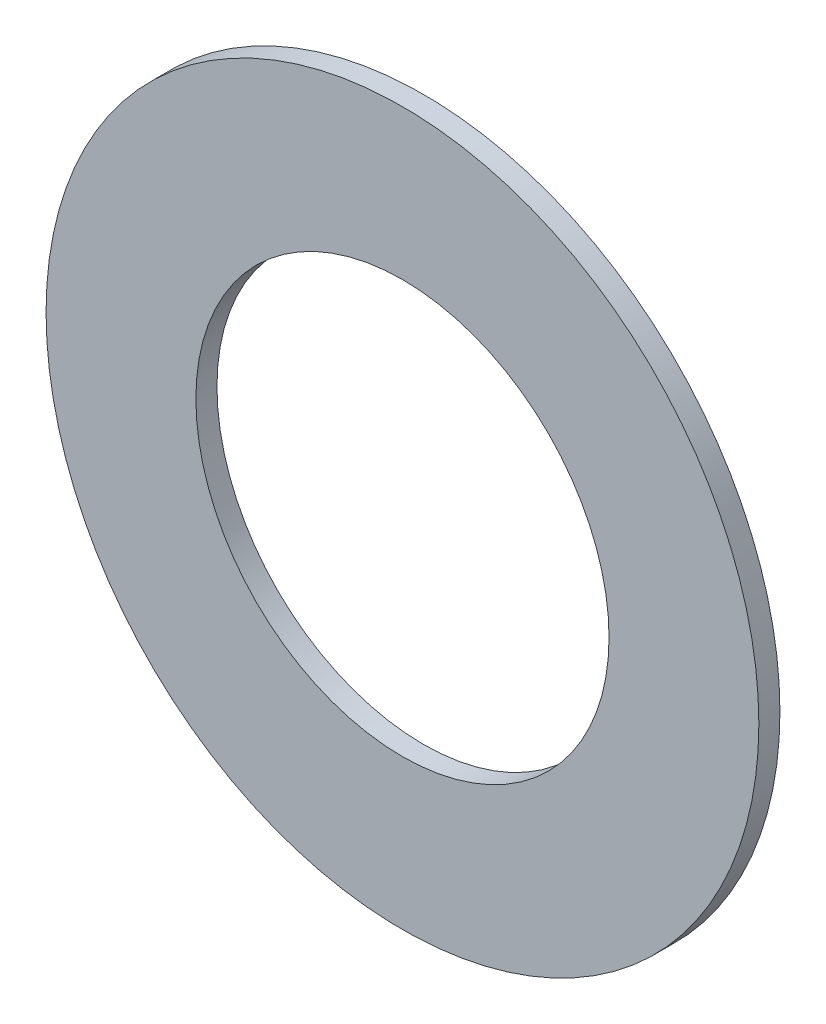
ISO-10303-21;
HEADER;
FILE_DESCRIPTION(('STEP AP214'),'2;1');
FILE_NAME('part.step','',(''),(''),'','','');
FILE_SCHEMA(('AUTOMOTIVE_DESIGN { 1 0 10303 214 1 1 1 1 }'));
ENDSEC;
DATA;
#1=APPLICATION_CONTEXT('core data for automotive mechanical design processes');
#2=APPLICATION_PROTOCOL_DEFINITION('international standard','automotive_design',2000,#1);
#3=PRODUCT_CONTEXT('',#1,'mechanical');
#4=PRODUCT('Part','Part','',(#3));
#5=PRODUCT_RELATED_PRODUCT_CATEGORY('part','',(#4));
#6=PRODUCT_DEFINITION_FORMATION('','',#4);
#7=PRODUCT_DEFINITION_CONTEXT('part definition',#1,'design');
#8=PRODUCT_DEFINITION('design','',#6,#7);
#9=PRODUCT_DEFINITION_SHAPE('','',#8);
#10=(LENGTH_UNIT() NAMED_UNIT(*) SI_UNIT(.MILLI.,.METRE.));
#11=(NAMED_UNIT(*) PLANE_ANGLE_UNIT() SI_UNIT($,.RADIAN.));
#12=(NAMED_UNIT(*) SI_UNIT($,.STERADIAN.) SOLID_ANGLE_UNIT());
#13=UNCERTAINTY_MEASURE_WITH_UNIT(LENGTH_MEASURE(1.E-05),#10,'distance_accuracy_value','');
#14=(GEOMETRIC_REPRESENTATION_CONTEXT(3) GLOBAL_UNCERTAINTY_ASSIGNED_CONTEXT((#13)) GLOBAL_UNIT_ASSIGNED_CONTEXT((#10,
#11,#12)) REPRESENTATION_CONTEXT('',''));
#15=CARTESIAN_POINT('',(0.,0.,0.));
#16=DIRECTION('',(0.,0.,1.));
#17=DIRECTION('',(1.,0.,0.));
#18=AXIS2_PLACEMENT_3D('',#15,#16,#17);
#19=CARTESIAN_POINT('',(0.,0.,1.5875));
#20=DIRECTION('',(0.,0.,1.));
#21=DIRECTION('',(1.,0.,0.));
#22=AXIS2_PLACEMENT_3D('',#19,#20,#21);
#23=PLANE('',#22);
#24=CARTESIAN_POINT('',(0.,0.,1.5875));
#25=DIRECTION('',(0.,0.,1.));
#26=DIRECTION('',(1.,0.,0.));
#27=AXIS2_PLACEMENT_3D('',#24,#25,#26);
#28=CIRCLE('',#27,53.6802159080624);
#29=CARTESIAN_POINT('',(53.6802159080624,0.,1.5875));
#30=VERTEX_POINT('',#29);
#31=EDGE_CURVE('E10',#30,#30,#28,.T.);
#32=ORIENTED_EDGE('',*,*,#31,.T.);
#33=EDGE_LOOP('',(#32));
#34=FACE_BOUND('',#33,.T.);
#35=CARTESIAN_POINT('',(0.,0.,1.5875));
#36=DIRECTION('',(0.,0.,1.));
#37=DIRECTION('',(1.,0.,0.));
#38=AXIS2_PLACEMENT_3D('',#35,#36,#37);
#39=CIRCLE('',#38,31.115);
#40=CARTESIAN_POINT('',(31.115,0.,1.5875));
#41=VERTEX_POINT('',#40);
#42=EDGE_CURVE('E55',#41,#41,#39,.T.);
#43=ORIENTED_EDGE('',*,*,#42,.F.);
#44=EDGE_LOOP('',(#43));
#45=FACE_BOUND('',#44,.T.);
#46=ADVANCED_FACE('F41',(#34,#45),#23,.T.);
#47=CARTESIAN_POINT('',(0.,0.,-1.5875));
#48=DIRECTION('',(0.,0.,1.));
#49=DIRECTION('',(1.,0.,0.));
#50=AXIS2_PLACEMENT_3D('',#47,#48,#49);
#51=PLANE('',#50);
#52=CARTESIAN_POINT('',(0.,0.,-1.5875));
#53=DIRECTION('',(0.,0.,1.));
#54=DIRECTION('',(1.,0.,0.));
#55=AXIS2_PLACEMENT_3D('',#52,#53,#54);
#56=CIRCLE('',#55,53.6802159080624);
#57=CARTESIAN_POINT('',(53.6802159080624,0.,-1.5875));
#58=VERTEX_POINT('',#57);
#59=EDGE_CURVE('E44',#58,#58,#56,.T.);
#60=ORIENTED_EDGE('',*,*,#59,.F.);
#61=EDGE_LOOP('',(#60));
#62=FACE_BOUND('',#61,.T.);
#63=CARTESIAN_POINT('',(0.,0.,-1.5875));
#64=DIRECTION('',(0.,0.,1.));
#65=DIRECTION('',(1.,0.,0.));
#66=AXIS2_PLACEMENT_3D('',#63,#64,#65);
#67=CIRCLE('',#66,31.115);
#68=CARTESIAN_POINT('',(31.115,0.,-1.5875));
#69=VERTEX_POINT('',#68);
#70=EDGE_CURVE('E53',#69,#69,#67,.T.);
#71=ORIENTED_EDGE('',*,*,#70,.T.);
#72=EDGE_LOOP('',(#71));
#73=FACE_BOUND('',#72,.T.);
#74=ADVANCED_FACE('F63',(#62,#73),#51,.F.);
#75=CARTESIAN_POINT('',(0.,0.,1.5875));
#76=DIRECTION('',(0.,0.,-1.));
#77=DIRECTION('',(-1.,0.,0.));
#78=AXIS2_PLACEMENT_3D('',#75,#76,#77);
#79=CYLINDRICAL_SURFACE('',#78,53.6802159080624);
#80=ORIENTED_EDGE('',*,*,#31,.F.);
#81=EDGE_LOOP('',(#80));
#82=FACE_BOUND('',#81,.T.);
#83=ORIENTED_EDGE('',*,*,#59,.T.);
#84=EDGE_LOOP('',(#83));
#85=FACE_BOUND('',#84,.T.);
#86=ADVANCED_FACE('F43',(#82,#85),#79,.T.);
#87=CARTESIAN_POINT('',(0.,0.,1.5875));
#88=DIRECTION('',(0.,0.,-1.));
#89=DIRECTION('',(-1.,0.,0.));
#90=AXIS2_PLACEMENT_3D('',#87,#88,#89);
#91=CYLINDRICAL_SURFACE('',#90,31.115);
#92=ORIENTED_EDGE('',*,*,#42,.T.);
#93=EDGE_LOOP('',(#92));
#94=FACE_BOUND('',#93,.T.);
#95=ORIENTED_EDGE('',*,*,#70,.F.);
#96=EDGE_LOOP('',(#95));
#97=FACE_BOUND('',#96,.T.);
#98=ADVANCED_FACE('F58',(#94,#97),#91,.F.);
#99=CLOSED_SHELL('',(#46,#74,#86,#98));
#100=MANIFOLD_SOLID_BREP('B2',#99);
#101=ADVANCED_BREP_SHAPE_REPRESENTATION('',(#18,#100),#14);
#102=SHAPE_DEFINITION_REPRESENTATION(#9,#101);
ENDSEC;
END-ISO-10303-21;
